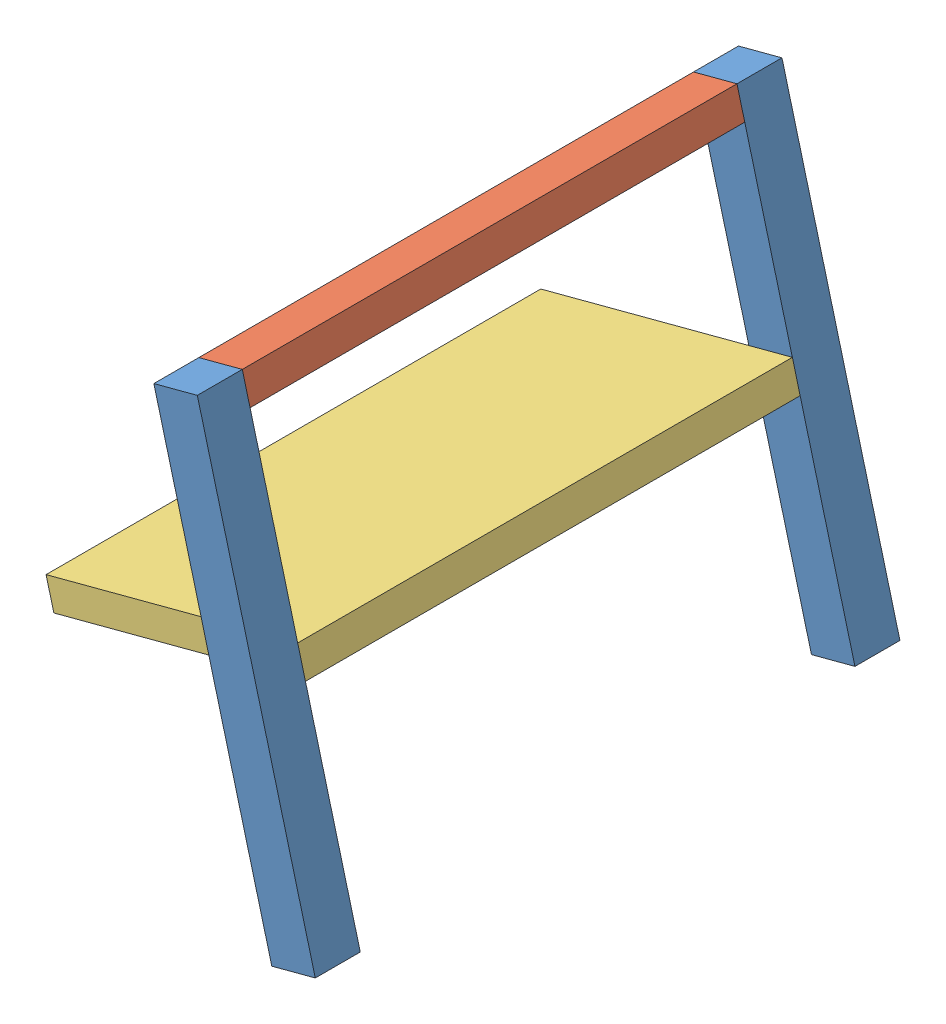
SolidWorks assembly PARTIE FIXE.SLDASM, configuration Défaut (file format 7000). Lengths in mm.
Overall size (501.27 511.51 520).
8 component instances, 5 part files, 12 mates.
Components (placement in the parent):
- longeron-1: longeron.SLDPRT [Défaut] at (118.5806 -91.2731 0) x (0.966698 0.255919 0) z (0 0 1) size (410 40 40)
- diagonle-1: diagonle.SLDPRT [Défaut] at (118.5806 -91.2731 0) x (0.966698 0.255919 0) z (0 0 1) size (370 370 40)
- MONTANT PARTIE fixe-1: MONTANT PARTIE fixe.SLDPRT [Défaut] at (118.5806 -91.2731 0) x (0.966698 0.255919 0) z (0 0 1) size (40 410 40)
- MONTANT PARTIE fixe-2: MONTANT PARTIE fixe.SLDPRT [Défaut] at (118.5806 -91.2731 -480) x (0.966698 0.255919 0) z (0 0 1) size (40 410 40)
- diagonle-2: diagonle.SLDPRT [Défaut] at (118.5806 -91.2731 -480) x (0.966698 0.255919 0) z (0 0 1) size (370 370 40)
- longeron-2: longeron.SLDPRT [Défaut] at (118.5806 -91.2731 -480) x (0.966698 0.255919 0) z (0 0 1) size (410 40 40)
- BARRE-1: BARRE.SLDPRT [Défaut] at (20.5636 278.9723 -520) x (0.966698 0.255919 0) z (0.255919 -0.966698 0) size (40 440 27)
- PLATEFORME-1: PLATEFORME.SLDPRT [Défaut] at (118.8365 -92.2398 -480) x (0.966698 0.255919 0) z (0 0 1) size (231.5 27 440)
Mates (geometry in assembly coordinates):
- Coïncidente26: coincident aligned: plane of MONTANT PARTIE fixe-1 through (118.5806 -91.2731 0) normal (0 0 1); plane of longeron-1 through (118.5806 -91.2731 0) normal (0 0 1)
- Coïncidente27: coincident anti-aligned: plane of MONTANT PARTIE fixe-1 through (410 410 -40) normal (-0.966698 -0.255919 0); plane of longeron-1 through (504.6901 52.3217 -40) normal (0.966698 0.255919 0)
- Coïncidente28: coincident aligned: plane of MONTANT PARTIE fixe-1 through (553.5948 23.8905 -40) normal (0.255919 -0.966698 0); plane of longeron-1 through (514.9268 13.6537 -40) normal (0.255919 -0.966698 0)
- Coïncidente29: coincident aligned: plane of MONTANT PARTIE fixe-1 through (118.5806 -91.2731 0) normal (0 0 1); plane of diagonle-1 through (118.5806 -91.2731 0) normal (0 0 1)
- Coïncidente30: coincident anti-aligned: plane of MONTANT PARTIE fixe-1 through (410 410 -40) normal (-0.966698 -0.255919 0); plane of diagonle-1 through (410 410 -40) normal (0.966698 0.255919 0)
- Coïncidente31: coincident: plane of MONTANT PARTIE fixe-1 through (448.6679 420.2368 -40) normal (-0.255919 0.966698 0); line of diagonle-1 through (410 410 -40) axis (0 0 1)
- Coïncidente38: coincident aligned: plane of MONTANT PARTIE fixe-2 through (448.6679 420.2368 -520) normal (0.966698 0.255919 0); plane of PLATEFORME-1 through (504.8422 208.0465 193.0692) normal (0.966698 0.255919 0)
- Coïncidente39: coincident anti-aligned: plane of MONTANT PARTIE fixe-2 through (118.5806 -91.2731 -480) normal (0 0 1); plane of PLATEFORME-1 through (118.8365 -92.2398 -480) normal (0 0 -1)
- Distance2: distance = 190.5 mm aligned: plane of longeron-1 through (514.9268 13.6537 -40) normal (0.255919 -0.966698 0); plane of PLATEFORME-1 through (504.8422 208.0465 193.0692) normal (0.255919 -0.966698 0)
- Coïncidente41: coincident aligned: plane of MONTANT PARTIE fixe-2 through (448.6679 420.2368 -520) normal (0.966698 0.255919 0); plane of BARRE-1 through (448.6679 420.2368 -40) normal (0.966698 0.255919 0)
- Coïncidente42: coincident anti-aligned: plane of MONTANT PARTIE fixe-2 through (118.5806 -91.2731 -480) normal (0 0 1); plane of BARRE-1 through (410 410 -480) normal (0 0 -1)
- Coïncidente43: coincident aligned: plane of MONTANT PARTIE fixe-2 through (448.6679 420.2368 -520) normal (-0.255919 0.966698 0); plane of BARRE-1 through (13.6537 305.0732 -520) normal (-0.255919 0.966698 0)
